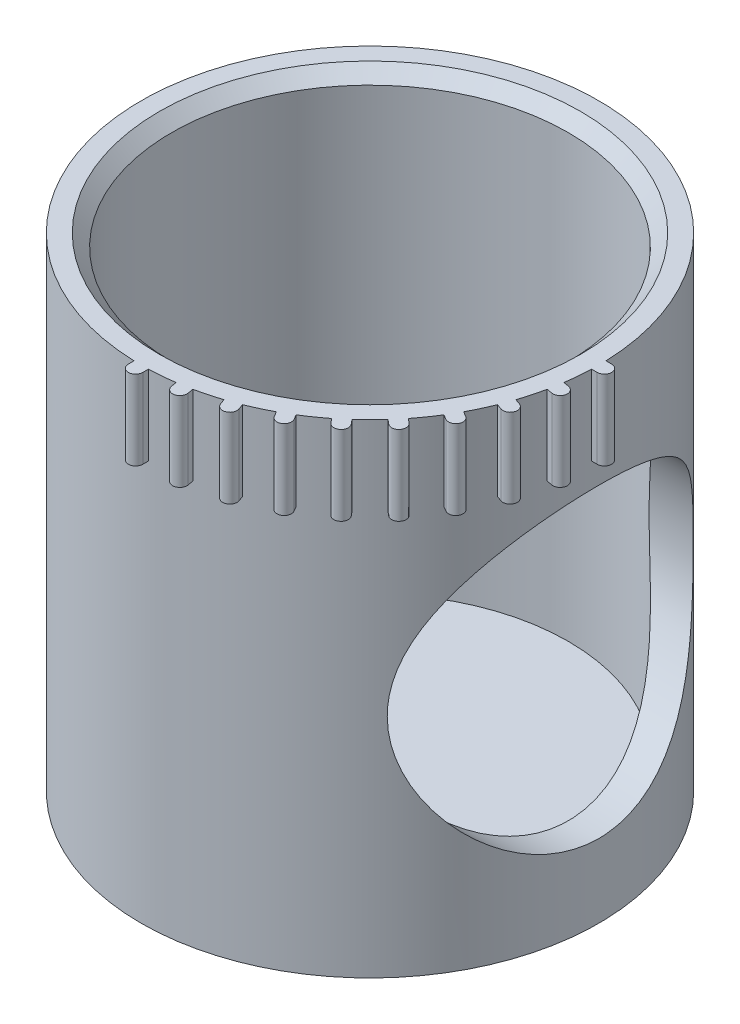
from build123d import *

# Parameters (mm, degrees)
ESQUISSE6_R                  = 16.2
BOSS_EXTRU_2_DEPTH           = 37
COQUE2_T                     = 2.5
ESQUISSE7_R                  = 12.5
ENL_V_MAT_EXTRU_3_DEPTH      = 46.479445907
BOSS_EXTRU_4_DEPTH           = 6.5
R_P_TITION_CIRCULAIRE2_COUNT = 10
R_P_TITION_CIRCULAIRE2_ANGLE = 90
CHANFREIN1_SIZE              = 1


with BuildPart() as part:
    # Esquisse6 → Boss.-Extru.2 (new body)
    with BuildSketch(Plane(origin=(0, 0, 0), x_dir=(1, 0, 0), z_dir=(0, 1, 0))):
        with Locations(Location((0, 0, 0), (0, 0, 270))):
            Circle(ESQUISSE6_R)
    extrude(amount=BOSS_EXTRU_2_DEPTH)

    # Coque2
    coque2_openings = [part.faces().sort_by_distance(p)[0] for p in [
        (0, 37, 0),
    ]]
    offset(amount=COQUE2_T, openings=coque2_openings, kind=Kind.INTERSECTION)

    # Esquisse7 → Enl_v. mat.-Extru.3 (cut, through all)
    with BuildSketch(Plane(origin=(0, 0, 0), x_dir=(0, 0, -1), z_dir=(1, 0, 0))):
        with Locations(Location((0, 16, 0), (0, 0, 180))):
            Circle(ESQUISSE7_R)
    extrude(amount=ENL_V_MAT_EXTRU_3_DEPTH, mode=Mode.SUBTRACT)

    # Esquisse8 → Boss.-Extru.4 (add)
    with BuildSketch(Plane(origin=(0, 37, 0), x_dir=(1, 0, 0), z_dir=(0, 1, 0))):
        with BuildLine():
            Line((-0.589715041, -18.690699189), (0.589715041, -18.690699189))
            Line((0.589715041, -18.690699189), (0.589715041, -19.154095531))
            ThreePointArc((0.589715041, -19.154095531), (0, -19.743810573), (-0.589715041, -19.154095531))
            Line((-0.589715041, -19.154095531), (-0.589715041, -18.690699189))
        make_face()
    boss_extru_4 = extrude(amount=-BOSS_EXTRU_4_DEPTH)

    # R_p_tition circulaire2: Boss.-Extru.4 ×10 about axis
    r_p_tition_circulaire2_axis = Axis((0, 0, 0), (0, 1, 0))
    for i in range(1, R_P_TITION_CIRCULAIRE2_COUNT):
        add(boss_extru_4.rotate(r_p_tition_circulaire2_axis, i * R_P_TITION_CIRCULAIRE2_ANGLE / (R_P_TITION_CIRCULAIRE2_COUNT - 1)))

    # Chanfrein1
    chanfrein1_edges = [part.edges().sort_by_distance(p)[0] for p in [
        (0, 37, -16.2),
    ]]
    chamfer(chanfrein1_edges, length=CHANFREIN1_SIZE)


solid = part.part
